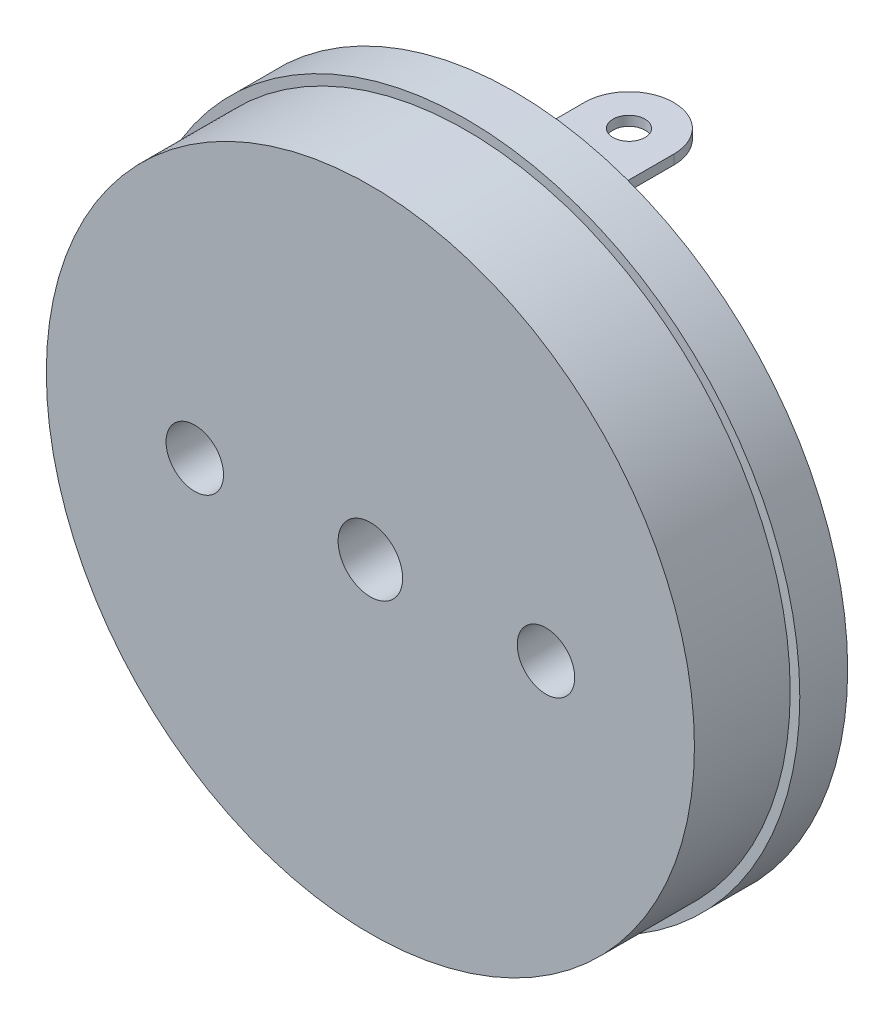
from build123d import *

# Parameters (mm, degrees)
ESQUISSE1_R             = 10.45
BASE_EXTRUSION_DEPTH    = 1.5
ESQUISSE2_R             = 10.15
BOSS_EXTRU_1_DEPTH      = 3
ESQUISSE4_R             = 0.9
ENL_V_MAT_EXTRU_2_DEPTH = 16.448462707
BOSS_EXTRU_3_DEPTH      = 2
ESQUISSE3_R             = 1.01
ENL_V_MAT_EXTRU_1_DEPTH = 17.144813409
ESQUISSE7_W             = 2.8
ESQUISSE7_H             = 0.3
BOSS_EXTRU_4_DEPTH      = 5
CONG_1_R                = 1.39
ESQUISSE8_R             = 0.5
ENL_V_MAT_EXTRU_3_DEPTH = 22.489823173
ESQUISSE9_R             = 1.129243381
ESQUISSE9_W             = 2.119235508
ESQUISSE9_H             = 2.258658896
ENL_V_MAT_EXTRU_4_DEPTH = 1


with BuildPart() as part:
    # Esquisse1 → Base-Extrusion (new body)
    with BuildSketch(Plane.XY):
        Circle(ESQUISSE1_R)
    extrude(amount=BASE_EXTRUSION_DEPTH)

    # Esquisse2 → Boss.-Extru.1 (add)
    with BuildSketch(Plane.XY.offset(1.5)):
        Circle(ESQUISSE2_R)
    extrude(amount=BOSS_EXTRU_1_DEPTH)

    # Esquisse4 (on Front Plane) → Enl_v. mat.-Extru.2 (cut, through all)
    with BuildSketch(Plane.XY):
        with Locations((-5.5, 0)):
            Circle(ESQUISSE4_R)
        with Locations(Location((5.5, 0, 0), (0, 0, 180))):
            Circle(ESQUISSE4_R)
    extrude(amount=ENL_V_MAT_EXTRU_2_DEPTH, mode=Mode.SUBTRACT)

    # Esquisse6 → Boss.-Extru.3 (add)
    with BuildSketch(Plane(origin=(0, 0, 0), x_dir=(-1, 0, 0), z_dir=(0, 0, -1))):
        with BuildLine():
            Line((2.327994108, 2.016641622), (2.327994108, -2.016641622))
            ThreePointArc((2.327994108, -2.016641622), (-3.08, 0), (2.327994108, 2.016641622))
        make_face()
    extrude(amount=BOSS_EXTRU_3_DEPTH)

    # Esquisse3 → Enl_v. mat.-Extru.1 (cut, through all)
    with BuildSketch(Plane.XY.offset(4.5)):
        Circle(ESQUISSE3_R)
    extrude(amount=-ENL_V_MAT_EXTRU_1_DEPTH, mode=Mode.SUBTRACT)

    # Esquisse7 → Boss.-Extru.4 (add)
    with BuildSketch(Plane(origin=(0, 0, 0), x_dir=(-1, 0, 0), z_dir=(0, 0, -1))):
        with Locations((0, 7.5)):
            Rectangle(ESQUISSE7_W, ESQUISSE7_H)
        with Locations((0, -7.5)):
            Rectangle(ESQUISSE7_W, ESQUISSE7_H)
    extrude(amount=BOSS_EXTRU_4_DEPTH)

    # Cong_1
    cong_1_edges = [part.edges().sort_by_distance(p)[0] for p in [
        (-1.4, -7.5, -5),
        (1.4, -7.5, -5),
        (1.4, 7.5, -5),
        (-1.4, 7.5, -5),
    ]]
    fillet(cong_1_edges, radius=CONG_1_R)

    # Esquisse8 → Enl_v. mat.-Extru.3 (cut, through all)
    with BuildSketch(Plane(origin=(0, 7.65, 0), x_dir=(-1, 0, 0), z_dir=(0, 1, 0))):
        with Locations(Location((0, -3.6, 0), (0, 0, 90))):
            Circle(ESQUISSE8_R)
    extrude(amount=-ENL_V_MAT_EXTRU_3_DEPTH, mode=Mode.SUBTRACT)

    # Esquisse9 → Enl_v. mat.-Extru.4 (cut)
    with BuildSketch(Plane(origin=(0, 0, 0), x_dir=(-1, 0, 0), z_dir=(0, 0, -1))):
        with Locations((3.625008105, 7.082708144)):
            Circle(ESQUISSE9_R)
        with Locations((-3.875970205, -6.789919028)):
            Rectangle(ESQUISSE9_W, ESQUISSE9_H)
    extrude(amount=-ENL_V_MAT_EXTRU_4_DEPTH, mode=Mode.SUBTRACT)


solid = part.part
